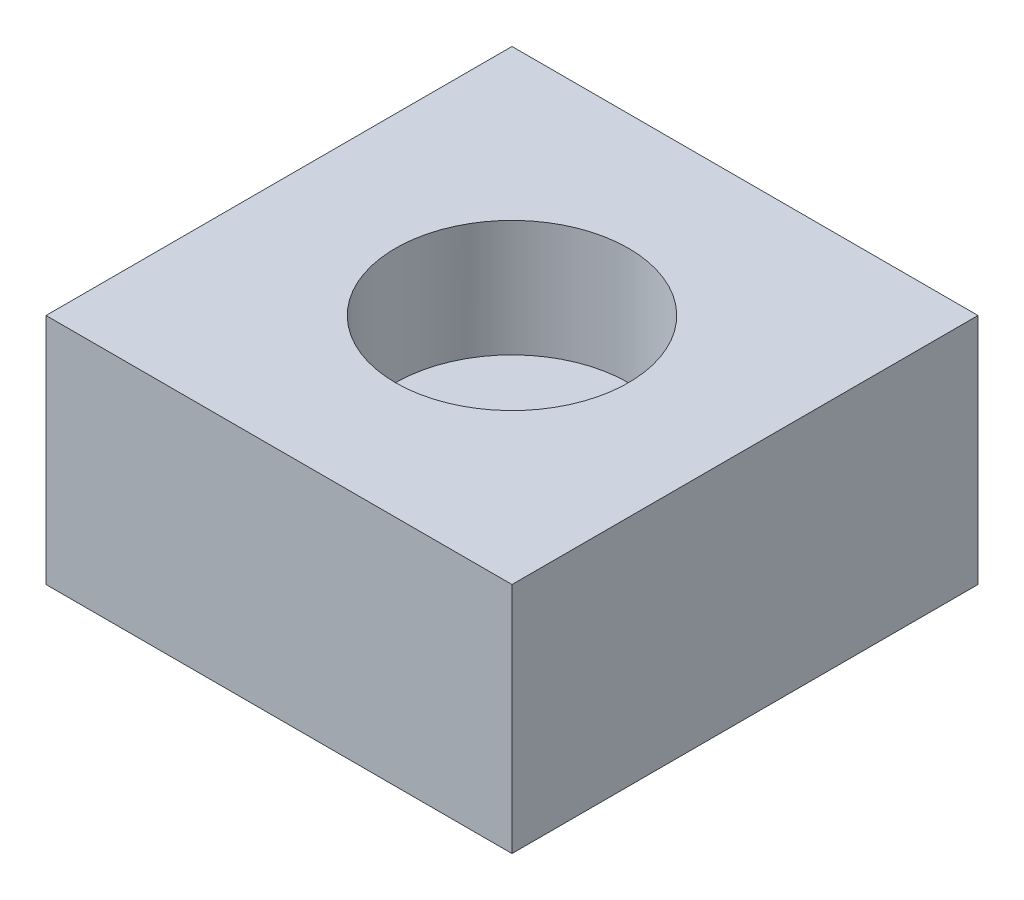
from build123d import *

# Parameters (mm, degrees)
SKETCH1_W           = 2000
SKETCH1_H           = 2000
SKETCH1_R           = 500
BOSS_EXTRUDE1_DEPTH = 1000
SKETCH2_R           = 500
BOSS_EXTRUDE2_DEPTH = 500


with BuildPart() as part:
    # Sketch1 → Boss-Extrude1 (new body)
    with BuildSketch(Plane(origin=(0, 0, 0), x_dir=(1, 0, 0), z_dir=(0, 1, 0))):
        Rectangle(SKETCH1_W, SKETCH1_H)
        with Locations(Location((0, 0, 0), (0, 0, 270))):
            Circle(SKETCH1_R, mode=Mode.SUBTRACT)
    extrude(amount=BOSS_EXTRUDE1_DEPTH)

    # Sketch2 → Boss-Extrude2 (add)
    with BuildSketch(Plane.XZ):
        with Locations(Location((0, 0, 0), (0, 0, 270))):
            Circle(SKETCH2_R)
    extrude(amount=-BOSS_EXTRUDE2_DEPTH)


solid = part.part
